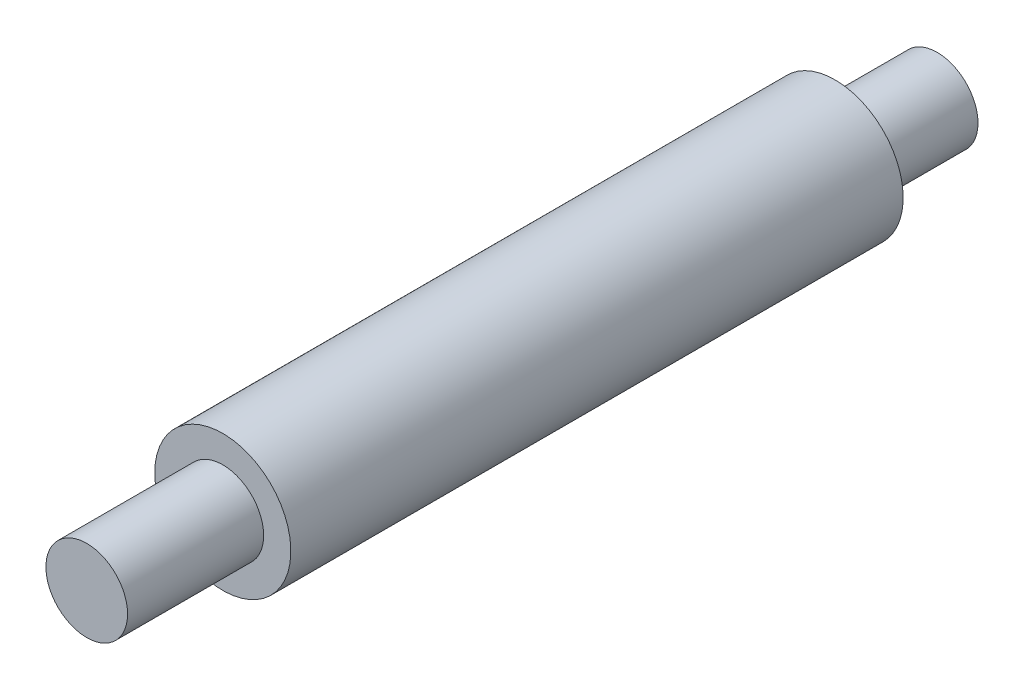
ISO-10303-21;
HEADER;
FILE_DESCRIPTION(('STEP AP214'),'2;1');
FILE_NAME('part.step','',(''),(''),'','','');
FILE_SCHEMA(('AUTOMOTIVE_DESIGN { 1 0 10303 214 1 1 1 1 }'));
ENDSEC;
DATA;
#1=APPLICATION_CONTEXT('core data for automotive mechanical design processes');
#2=APPLICATION_PROTOCOL_DEFINITION('international standard','automotive_design',2000,#1);
#3=PRODUCT_CONTEXT('',#1,'mechanical');
#4=PRODUCT('Part','Part','',(#3));
#5=PRODUCT_RELATED_PRODUCT_CATEGORY('part','',(#4));
#6=PRODUCT_DEFINITION_FORMATION('','',#4);
#7=PRODUCT_DEFINITION_CONTEXT('part definition',#1,'design');
#8=PRODUCT_DEFINITION('design','',#6,#7);
#9=PRODUCT_DEFINITION_SHAPE('','',#8);
#10=(LENGTH_UNIT() NAMED_UNIT(*) SI_UNIT(.MILLI.,.METRE.));
#11=(NAMED_UNIT(*) PLANE_ANGLE_UNIT() SI_UNIT($,.RADIAN.));
#12=(NAMED_UNIT(*) SI_UNIT($,.STERADIAN.) SOLID_ANGLE_UNIT());
#13=UNCERTAINTY_MEASURE_WITH_UNIT(LENGTH_MEASURE(1.E-05),#10,'distance_accuracy_value','');
#14=(GEOMETRIC_REPRESENTATION_CONTEXT(3) GLOBAL_UNCERTAINTY_ASSIGNED_CONTEXT((#13)) GLOBAL_UNIT_ASSIGNED_CONTEXT((#10,
#11,#12)) REPRESENTATION_CONTEXT('',''));
#15=CARTESIAN_POINT('',(0.,0.,0.));
#16=DIRECTION('',(0.,0.,1.));
#17=DIRECTION('',(1.,0.,0.));
#18=AXIS2_PLACEMENT_3D('',#15,#16,#17);
#19=CARTESIAN_POINT('',(0.,0.,90.));
#20=DIRECTION('',(0.,0.,-1.));
#21=DIRECTION('',(-1.,0.,0.));
#22=AXIS2_PLACEMENT_3D('',#19,#20,#21);
#23=CYLINDRICAL_SURFACE('',#22,10.);
#24=CARTESIAN_POINT('',(0.,0.,90.));
#25=DIRECTION('',(0.,0.,1.));
#26=DIRECTION('',(1.,0.,0.));
#27=AXIS2_PLACEMENT_3D('',#24,#25,#26);
#28=CIRCLE('',#27,10.);
#29=CARTESIAN_POINT('',(-10.,0.,90.));
#30=VERTEX_POINT('',#29);
#31=EDGE_CURVE('E46',#30,#30,#28,.T.);
#32=CARTESIAN_POINT('',(0.,0.,0.));
#33=DIRECTION('',(0.,0.,1.));
#34=DIRECTION('',(1.,0.,0.));
#35=AXIS2_PLACEMENT_3D('',#32,#33,#34);
#36=CIRCLE('',#35,10.);
#37=CARTESIAN_POINT('',(-10.,0.,0.));
#38=VERTEX_POINT('',#37);
#39=EDGE_CURVE('E54',#38,#38,#36,.T.);
#40=CARTESIAN_POINT('',(-10.,0.,90.));
#41=CARTESIAN_POINT('',(-10.,0.,89.0625));
#42=CARTESIAN_POINT('',(-10.,0.,88.125));
#43=CARTESIAN_POINT('',(-10.,0.,86.25));
#44=CARTESIAN_POINT('',(-10.,0.,85.3125));
#45=CARTESIAN_POINT('',(-10.,0.,83.4375));
#46=CARTESIAN_POINT('',(-10.,0.,82.5));
#47=CARTESIAN_POINT('',(-10.,0.,80.625));
#48=CARTESIAN_POINT('',(-10.,0.,79.6875));
#49=CARTESIAN_POINT('',(-10.,0.,77.8125));
#50=CARTESIAN_POINT('',(-10.,0.,76.875));
#51=CARTESIAN_POINT('',(-10.,0.,75.));
#52=CARTESIAN_POINT('',(-10.,0.,74.0625));
#53=CARTESIAN_POINT('',(-10.,0.,72.1875));
#54=CARTESIAN_POINT('',(-10.,0.,71.25));
#55=CARTESIAN_POINT('',(-10.,0.,69.375));
#56=CARTESIAN_POINT('',(-10.,0.,68.4375));
#57=CARTESIAN_POINT('',(-10.,0.,66.5625));
#58=CARTESIAN_POINT('',(-10.,0.,65.625));
#59=CARTESIAN_POINT('',(-10.,0.,63.75));
#60=CARTESIAN_POINT('',(-10.,0.,62.8125));
#61=CARTESIAN_POINT('',(-10.,0.,60.9375));
#62=CARTESIAN_POINT('',(-10.,0.,60.));
#63=CARTESIAN_POINT('',(-10.,0.,58.125));
#64=CARTESIAN_POINT('',(-10.,0.,57.1875));
#65=CARTESIAN_POINT('',(-10.,0.,55.3125));
#66=CARTESIAN_POINT('',(-10.,0.,54.375));
#67=CARTESIAN_POINT('',(-10.,0.,52.5));
#68=CARTESIAN_POINT('',(-10.,0.,51.5625));
#69=CARTESIAN_POINT('',(-10.,0.,49.6875));
#70=CARTESIAN_POINT('',(-10.,0.,48.75));
#71=CARTESIAN_POINT('',(-10.,0.,46.875));
#72=CARTESIAN_POINT('',(-10.,0.,45.9375));
#73=CARTESIAN_POINT('',(-10.,0.,44.0625));
#74=CARTESIAN_POINT('',(-10.,0.,43.125));
#75=CARTESIAN_POINT('',(-10.,0.,41.25));
#76=CARTESIAN_POINT('',(-10.,0.,40.3125));
#77=CARTESIAN_POINT('',(-10.,0.,38.4375));
#78=CARTESIAN_POINT('',(-10.,0.,37.5));
#79=CARTESIAN_POINT('',(-10.,0.,35.625));
#80=CARTESIAN_POINT('',(-10.,0.,34.6875));
#81=CARTESIAN_POINT('',(-10.,0.,32.8125));
#82=CARTESIAN_POINT('',(-10.,0.,31.875));
#83=CARTESIAN_POINT('',(-10.,0.,30.));
#84=CARTESIAN_POINT('',(-10.,0.,29.0625));
#85=CARTESIAN_POINT('',(-10.,0.,27.1875));
#86=CARTESIAN_POINT('',(-10.,0.,26.25));
#87=CARTESIAN_POINT('',(-10.,0.,24.375));
#88=CARTESIAN_POINT('',(-10.,0.,23.4375));
#89=CARTESIAN_POINT('',(-10.,0.,21.5625));
#90=CARTESIAN_POINT('',(-10.,0.,20.625));
#91=CARTESIAN_POINT('',(-10.,0.,18.75));
#92=CARTESIAN_POINT('',(-10.,0.,17.8125));
#93=CARTESIAN_POINT('',(-10.,0.,15.9375));
#94=CARTESIAN_POINT('',(-10.,0.,15.));
#95=CARTESIAN_POINT('',(-10.,0.,13.125));
#96=CARTESIAN_POINT('',(-10.,0.,12.1875));
#97=CARTESIAN_POINT('',(-10.,0.,10.3125));
#98=CARTESIAN_POINT('',(-10.,0.,9.37499999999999));
#99=CARTESIAN_POINT('',(-10.,0.,7.49999999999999));
#100=CARTESIAN_POINT('',(-10.,0.,6.56249999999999));
#101=CARTESIAN_POINT('',(-10.,0.,4.68749999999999));
#102=CARTESIAN_POINT('',(-10.,0.,3.74999999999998));
#103=CARTESIAN_POINT('',(-10.,0.,1.87499999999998));
#104=CARTESIAN_POINT('',(-10.,0.,0.937499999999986));
#105=CARTESIAN_POINT('',(-10.,0.,0.));
#106=B_SPLINE_CURVE_WITH_KNOTS('',3,(#40,#41,#42,#43,#44,#45,#46,#47,#48,#49,#50,#51,#52,#53,
#54,#55,#56,#57,#58,#59,#60,#61,#62,#63,#64,#65,#66,#67,#68,#69,#70,#71,#72,#73,#74,#75,#76,#77,
#78,#79,#80,#81,#82,#83,#84,#85,#86,#87,#88,#89,#90,#91,#92,#93,#94,#95,#96,#97,#98,#99,#100,
#101,#102,#103,#104,#105),.UNSPECIFIED.,.F.,.F.,(4,2,2,2,2,2,2,2,2,2,2,2,2,2,2,2,2,2,2,2,2,2,2,
2,2,2,2,2,2,2,2,2,4),(0.,2.81250000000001,5.62500000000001,8.43750000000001,11.25,14.0625,
16.875,19.6875,22.5,25.3125,28.125,30.9375,33.75,36.5625,39.375,42.1875,45.,47.8125,50.625,
53.4375,56.25,59.0625,61.875,64.6875,67.5,70.3125,73.125,75.9375,78.75,81.5625,84.375,87.1875,
90.),.UNSPECIFIED.);
#107=EDGE_CURVE('BSEAM39',#30,#38,#106,.T.);
#108=ORIENTED_EDGE('',*,*,#31,.F.);
#109=ORIENTED_EDGE('',*,*,#39,.T.);
#110=ORIENTED_EDGE('',*,*,#107,.T.);
#111=ORIENTED_EDGE('',*,*,#107,.F.);
#112=EDGE_LOOP('',(#108,#110,#109,#111));
#113=FACE_BOUND('',#112,.T.);
#114=ADVANCED_FACE('F39',(#113),#23,.T.);
#115=CARTESIAN_POINT('',(0.,0.,90.));
#116=DIRECTION('',(0.,0.,1.));
#117=DIRECTION('',(1.,0.,0.));
#118=AXIS2_PLACEMENT_3D('',#115,#116,#117);
#119=PLANE('',#118);
#120=CARTESIAN_POINT('',(0.,0.,90.));
#121=DIRECTION('',(0.,0.,1.));
#122=DIRECTION('',(1.,0.,0.));
#123=AXIS2_PLACEMENT_3D('',#120,#121,#122);
#124=CIRCLE('',#123,6.);
#125=CARTESIAN_POINT('',(6.,0.,90.));
#126=VERTEX_POINT('',#125);
#127=EDGE_CURVE('E63',#126,#126,#124,.T.);
#128=ORIENTED_EDGE('',*,*,#127,.F.);
#129=EDGE_LOOP('',(#128));
#130=FACE_BOUND('',#129,.T.);
#131=ORIENTED_EDGE('',*,*,#31,.T.);
#132=EDGE_LOOP('',(#131));
#133=FACE_BOUND('',#132,.T.);
#134=ADVANCED_FACE('F89',(#130,#133),#119,.T.);
#135=CARTESIAN_POINT('',(0.,0.,0.));
#136=DIRECTION('',(0.,0.,1.));
#137=DIRECTION('',(1.,0.,0.));
#138=AXIS2_PLACEMENT_3D('',#135,#136,#137);
#139=PLANE('',#138);
#140=CARTESIAN_POINT('',(0.,0.,0.));
#141=DIRECTION('',(0.,0.,1.));
#142=DIRECTION('',(1.,0.,0.));
#143=AXIS2_PLACEMENT_3D('',#140,#141,#142);
#144=CIRCLE('',#143,6.);
#145=CARTESIAN_POINT('',(6.,0.,0.));
#146=VERTEX_POINT('',#145);
#147=EDGE_CURVE('E10',#146,#146,#144,.F.);
#148=ORIENTED_EDGE('',*,*,#147,.F.);
#149=EDGE_LOOP('',(#148));
#150=FACE_BOUND('',#149,.T.);
#151=ORIENTED_EDGE('',*,*,#39,.F.);
#152=EDGE_LOOP('',(#151));
#153=FACE_BOUND('',#152,.T.);
#154=ADVANCED_FACE('F94',(#150,#153),#139,.F.);
#155=CARTESIAN_POINT('',(0.,0.,110.));
#156=DIRECTION('',(0.,0.,-1.));
#157=DIRECTION('',(-1.,0.,0.));
#158=AXIS2_PLACEMENT_3D('',#155,#156,#157);
#159=CYLINDRICAL_SURFACE('',#158,6.);
#160=CARTESIAN_POINT('',(0.,0.,110.));
#161=DIRECTION('',(0.,0.,1.));
#162=DIRECTION('',(1.,0.,0.));
#163=AXIS2_PLACEMENT_3D('',#160,#161,#162);
#164=CIRCLE('',#163,6.);
#165=CARTESIAN_POINT('',(6.,0.,110.));
#166=VERTEX_POINT('',#165);
#167=EDGE_CURVE('E61',#166,#166,#164,.T.);
#168=ORIENTED_EDGE('',*,*,#167,.F.);
#169=EDGE_LOOP('',(#168));
#170=FACE_BOUND('',#169,.T.);
#171=ORIENTED_EDGE('',*,*,#127,.T.);
#172=EDGE_LOOP('',(#171));
#173=FACE_BOUND('',#172,.T.);
#174=ADVANCED_FACE('F85',(#170,#173),#159,.T.);
#175=CARTESIAN_POINT('',(0.,0.,110.));
#176=DIRECTION('',(0.,0.,1.));
#177=DIRECTION('',(1.,0.,0.));
#178=AXIS2_PLACEMENT_3D('',#175,#176,#177);
#179=PLANE('',#178);
#180=ORIENTED_EDGE('',*,*,#167,.T.);
#181=EDGE_LOOP('',(#180));
#182=FACE_BOUND('',#181,.T.);
#183=ADVANCED_FACE('F78',(#182),#179,.T.);
#184=CARTESIAN_POINT('',(0.,0.,-15.));
#185=DIRECTION('',(0.,0.,1.));
#186=DIRECTION('',(1.,0.,0.));
#187=AXIS2_PLACEMENT_3D('',#184,#185,#186);
#188=CYLINDRICAL_SURFACE('',#187,6.);
#189=CARTESIAN_POINT('',(0.,0.,-15.));
#190=DIRECTION('',(0.,0.,-1.));
#191=DIRECTION('',(-1.,0.,0.));
#192=AXIS2_PLACEMENT_3D('',#189,#190,#191);
#193=CIRCLE('',#192,6.);
#194=CARTESIAN_POINT('',(-6.,0.,-15.));
#195=VERTEX_POINT('',#194);
#196=EDGE_CURVE('E66',#195,#195,#193,.T.);
#197=ORIENTED_EDGE('',*,*,#196,.F.);
#198=EDGE_LOOP('',(#197));
#199=FACE_BOUND('',#198,.T.);
#200=ORIENTED_EDGE('',*,*,#147,.T.);
#201=EDGE_LOOP('',(#200));
#202=FACE_BOUND('',#201,.T.);
#203=ADVANCED_FACE('F76',(#199,#202),#188,.T.);
#204=CARTESIAN_POINT('',(0.,0.,-15.));
#205=DIRECTION('',(0.,0.,-1.));
#206=DIRECTION('',(-1.,0.,0.));
#207=AXIS2_PLACEMENT_3D('',#204,#205,#206);
#208=PLANE('',#207);
#209=ORIENTED_EDGE('',*,*,#196,.T.);
#210=EDGE_LOOP('',(#209));
#211=FACE_BOUND('',#210,.T.);
#212=ADVANCED_FACE('F74',(#211),#208,.T.);
#213=CLOSED_SHELL('',(#114,#134,#154,#174,#183,#203,#212));
#214=MANIFOLD_SOLID_BREP('B2',#213);
#215=ADVANCED_BREP_SHAPE_REPRESENTATION('',(#18,#214),#14);
#216=SHAPE_DEFINITION_REPRESENTATION(#9,#215);
ENDSEC;
END-ISO-10303-21;
